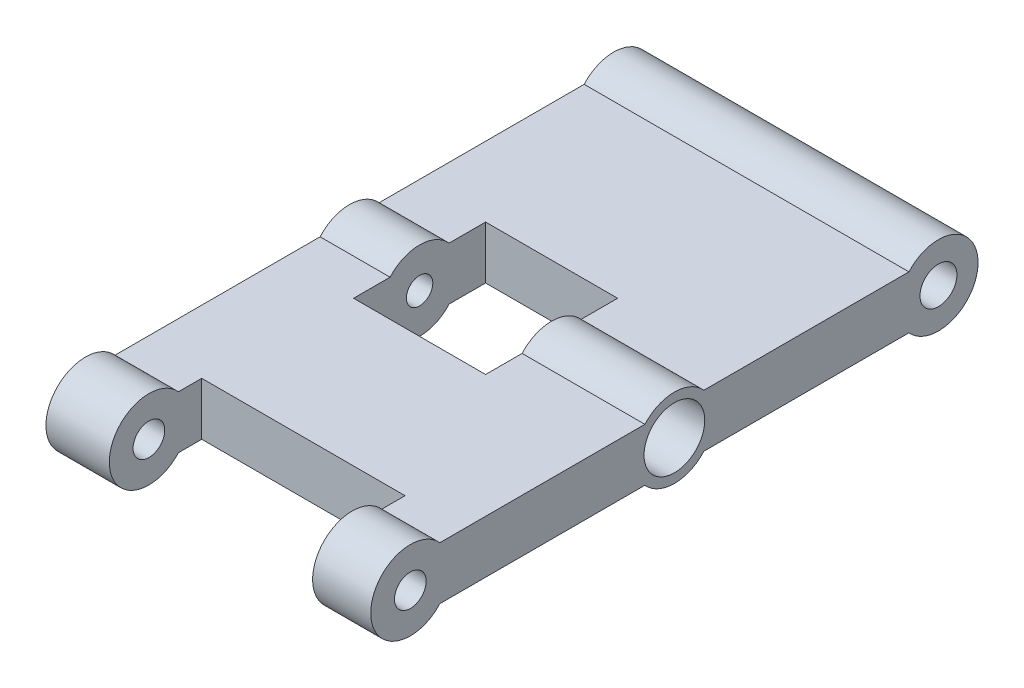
from build123d import *

# Parameters (mm, degrees)
SKETCH1_W               = 50.8
SKETCH1_H               = 5.08
BOSS_EXTRUDE1_DEPTH     = 31.242
SKETCH2_R               = 3.81
BOSS_EXTRUDE2_DEPTH     = 31.242
SKETCH3_W               = 19.558
SKETCH3_H               = 13.711267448
CUT_EXTRUDE1_DEPTH      = 15.875
SKETCH6_R               = 1.778
SKETCH6_R_2             = 1.524
CUT_EXTRUDE4_DEPTH      = 64.234778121
SKETCH7_R               = 3.81
BOSS_EXTRUDE3_DEPTH     = 31.242
SKETCH5_R               = 1.27
CUT_EXTRUDE5_DEPTH      = 64.234778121
CUT_EXTRUDE6_DEPTH      = 64.234778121
CUT_EXTRUDE6_DEPTH_BACK = 64.234778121
SKETCH4_W               = 12.7
SKETCH4_H               = 12.7
SKETCH8_R               = 2.921
CUT_EXTRUDE7_DEPTH      = 9.271
CUT_EXTRUDE8_START      = -4.191
SKETCH9_R               = 2.921
CUT_EXTRUDE8_DEPTH      = 4.191


with BuildPart() as part:
    # Sketch1 → Boss-Extrude1 (new body)
    with BuildSketch(Plane(origin=(0, 0, 0), x_dir=(0, 0, -1), z_dir=(1, 0, 0))):
        with Locations((25.4, 2.54)):
            Rectangle(SKETCH1_W, SKETCH1_H)
    extrude(amount=BOSS_EXTRUDE1_DEPTH)

    # Sketch2 → Boss-Extrude2 (add)
    with BuildSketch(Plane(origin=(31.242, 0, 0), x_dir=(0, 0, -1), z_dir=(1, 0, 0))):
        with Locations((0, 2.54)):
            Circle(SKETCH2_R)
        with Locations((50.8, 2.54)):
            Circle(SKETCH2_R)
    extrude(amount=-BOSS_EXTRUDE2_DEPTH)

    # Sketch3 → Cut-Extrude1 (cut, symmetric)
    with BuildSketch(Plane(origin=(0, 5.08, 0), x_dir=(1, 0, 0), z_dir=(0, 1, 0))):
        with Locations((15.875, -1.775633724)):
            Rectangle(SKETCH3_W, SKETCH3_H)
    extrude(amount=CUT_EXTRUDE1_DEPTH, both=True, mode=Mode.SUBTRACT)

    # Sketch6 → Cut-Extrude4 (cut, through all)
    with BuildSketch(Plane.ZY):
        with Locations((-50.8, 2.54)):
            Circle(SKETCH6_R)
        with Locations((0, 2.54)):
            Circle(SKETCH6_R_2)
    extrude(amount=-CUT_EXTRUDE4_DEPTH, mode=Mode.SUBTRACT)

    # Sketch7 → Boss-Extrude3 (add)
    with BuildSketch(Plane.ZY):
        with Locations((-25.4, 2.54)):
            Circle(SKETCH7_R)
    extrude(amount=-BOSS_EXTRUDE3_DEPTH)

    # Sketch5 → Cut-Extrude5 (cut, through all)
    with BuildSketch(Plane.ZY):
        with Locations((-25.4, 2.54)):
            Circle(SKETCH5_R)
    extrude(amount=-CUT_EXTRUDE5_DEPTH, mode=Mode.SUBTRACT)

    # Sketch4 → Cut-Extrude6 (cut, two sides: drawn at the far end of the back side and taken through both)
    with BuildSketch(Plane(origin=(0, 5.08, 0), x_dir=(1, 0, 0), z_dir=(0, 1, 0)).offset(-CUT_EXTRUDE6_DEPTH_BACK)):
        with Locations((13.081, 25.4)):
            Rectangle(SKETCH4_W, SKETCH4_H)
    extrude(amount=CUT_EXTRUDE6_DEPTH + CUT_EXTRUDE6_DEPTH_BACK, mode=Mode.SUBTRACT)

    # Sketch8 → Cut-Extrude7 (cut)
    with BuildSketch(Plane(origin=(31.242, 0, 0), x_dir=(0, 0, -1), z_dir=(1, 0, 0))):
        with Locations((25.4, 2.54)):
            Circle(SKETCH8_R)
    extrude(amount=-CUT_EXTRUDE7_DEPTH, mode=Mode.SUBTRACT)

    # Sketch9 → Cut-Extrude8 (cut)
    with BuildSketch(Plane.ZY.offset(CUT_EXTRUDE8_START)):
        with Locations(Location((-25.4, 2.54, 0), (0, 0, 180))):
            Circle(SKETCH9_R)
    extrude(amount=CUT_EXTRUDE8_DEPTH, mode=Mode.SUBTRACT)


solid = part.part
